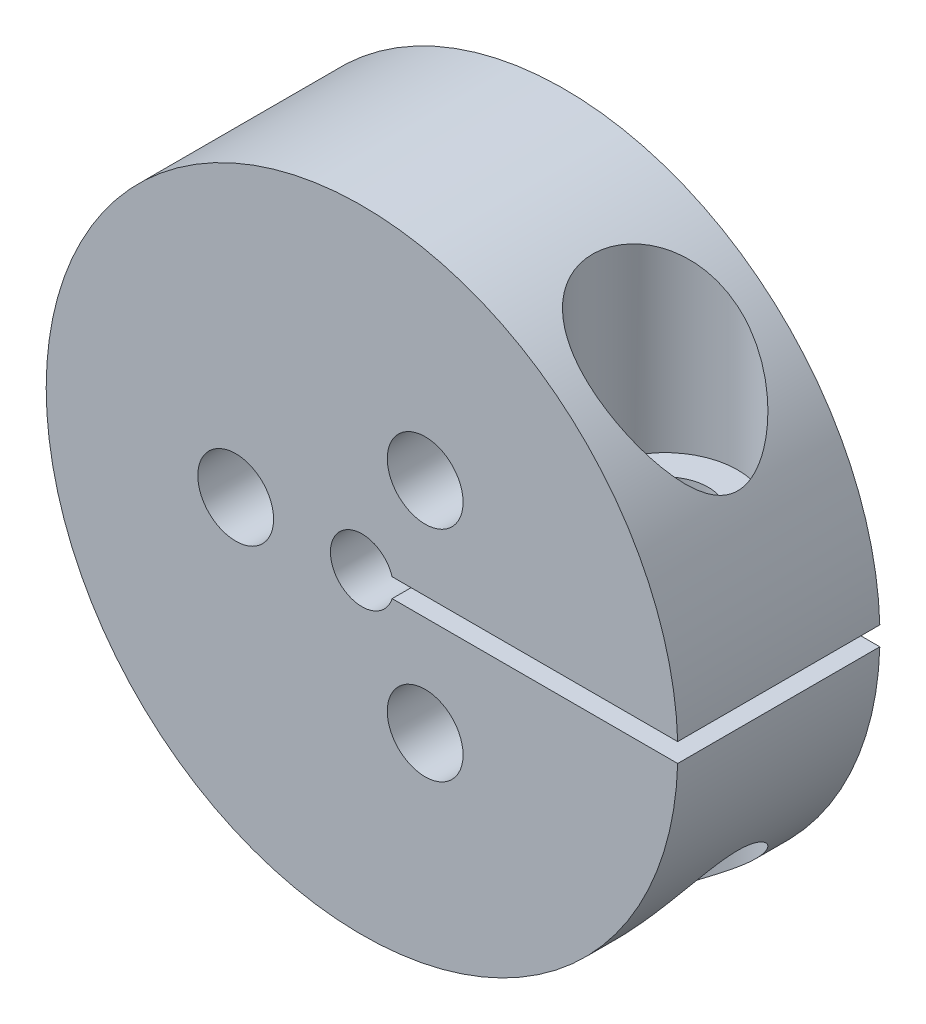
from build123d import *

# Parameters (mm, degrees)
SKETCH1_R               = 1.5
BOSS_EXTRUDE1_DEPTH     = 4
CUT_EXTRUDE1_DEPTH      = 19.12456896
CUT_EXTRUDE1_DEPTH_BACK = 19.12456896
SKETCH2_R               = 1.55
SKETCH3_R               = 2.875
CUT_EXTRUDE2_DEPTH      = 22.083168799
CUT_EXTRUDE3_REACH      = 23.083
SKETCH4_R               = 1.7


with BuildPart() as part:
    # Sketch1 → Boss-Extrude1 (new, symmetric)
    with BuildSketch(Plane.XY):
        with BuildLine():
            Line((12.494373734, -0.375), (1.192424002, -0.375))
            ThreePointArc((1.192424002, -0.375), (-1.25, 0), (1.192424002, 0.375))
            Line((1.192424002, 0.375), (12.494373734, 0.375))
            ThreePointArc((12.494373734, 0.375), (-12.5, 0), (12.494373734, -0.375))
        make_face()
        with Locations((2.5, -4.330127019)):
            Circle(SKETCH1_R, mode=Mode.SUBTRACT)
        with Locations((-5, 0)):
            Circle(SKETCH1_R, mode=Mode.SUBTRACT)
        with Locations((2.5, 4.330127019)):
            Circle(SKETCH1_R, mode=Mode.SUBTRACT)
    extrude(amount=BOSS_EXTRUDE1_DEPTH, both=True)

    # Sketch2 → Cut-Extrude1 (cut, two sides: drawn at the far end of the back side and taken through both)
    with BuildSketch(Plane(origin=(0, 0, 0), x_dir=(1, 0, 0), z_dir=(0, 1, 0)).offset(-CUT_EXTRUDE1_DEPTH_BACK)):
        with Locations(Location((8, 0, 0), (0, 0, 270))):
            Circle(SKETCH2_R)
    extrude(amount=CUT_EXTRUDE1_DEPTH + CUT_EXTRUDE1_DEPTH_BACK, mode=Mode.SUBTRACT)

    # Sketch3 → Cut-Extrude2 (cut, through all)
    with BuildSketch(Plane(origin=(0, 4, 0), x_dir=(1, 0, 0), z_dir=(0, 1, 0))):
        with Locations(Location((8, 0, 0), (0, 0, 90))):
            Circle(SKETCH3_R)
    cut_extrude2 = extrude(amount=CUT_EXTRUDE2_DEPTH, mode=Mode.SUBTRACT)

    # Mirror1: Cut-Extrude2 across plane
    add(cut_extrude2.mirror(Plane.ZX), mode=Mode.SUBTRACT)

    # Sketch4 → Cut-Extrude3 (cut, up to next)
    with BuildSketch(Plane(origin=(0, 4, 0), x_dir=(1, 0, 0), z_dir=(0, 1, 0)), mode=Mode.PRIVATE) as cut_extrude3_sk1:
        with Locations(Location((8, 0, 0), (0, 0, 270))):
            Circle(SKETCH4_R)
    cut_extrude3_tool1 = extrude(cut_extrude3_sk1.sketch, amount=-CUT_EXTRUDE3_REACH, mode=Mode.PRIVATE) & part.part
    add(cut_extrude3_tool1.solids().sort_by_distance((8, 4, 0))[0], mode=Mode.SUBTRACT)


solid = part.part
